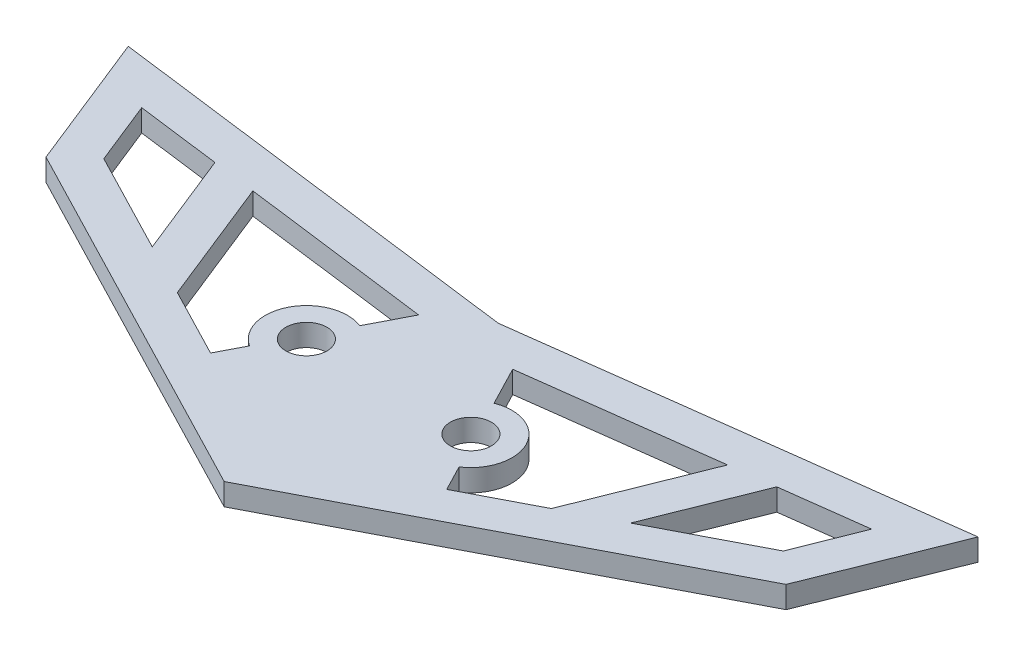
ISO-10303-21;
HEADER;
FILE_DESCRIPTION(('STEP AP214'),'2;1');
FILE_NAME('part.step','',(''),(''),'','','');
FILE_SCHEMA(('AUTOMOTIVE_DESIGN { 1 0 10303 214 1 1 1 1 }'));
ENDSEC;
DATA;
#1=APPLICATION_CONTEXT('core data for automotive mechanical design processes');
#2=APPLICATION_PROTOCOL_DEFINITION('international standard','automotive_design',2000,#1);
#3=PRODUCT_CONTEXT('',#1,'mechanical');
#4=PRODUCT('Part','Part','',(#3));
#5=PRODUCT_RELATED_PRODUCT_CATEGORY('part','',(#4));
#6=PRODUCT_DEFINITION_FORMATION('','',#4);
#7=PRODUCT_DEFINITION_CONTEXT('part definition',#1,'design');
#8=PRODUCT_DEFINITION('design','',#6,#7);
#9=PRODUCT_DEFINITION_SHAPE('','',#8);
#10=(LENGTH_UNIT() NAMED_UNIT(*) SI_UNIT(.MILLI.,.METRE.));
#11=(NAMED_UNIT(*) PLANE_ANGLE_UNIT() SI_UNIT($,.RADIAN.));
#12=(NAMED_UNIT(*) SI_UNIT($,.STERADIAN.) SOLID_ANGLE_UNIT());
#13=UNCERTAINTY_MEASURE_WITH_UNIT(LENGTH_MEASURE(1.E-05),#10,'distance_accuracy_value','');
#14=(GEOMETRIC_REPRESENTATION_CONTEXT(3) GLOBAL_UNCERTAINTY_ASSIGNED_CONTEXT((#13)) GLOBAL_UNIT_ASSIGNED_CONTEXT((#10,
#11,#12)) REPRESENTATION_CONTEXT('',''));
#15=CARTESIAN_POINT('',(0.,0.,0.));
#16=DIRECTION('',(0.,0.,1.));
#17=DIRECTION('',(1.,0.,0.));
#18=AXIS2_PLACEMENT_3D('',#15,#16,#17);
#19=CARTESIAN_POINT('',(0.,0.8,-10.));
#20=DIRECTION('',(0.,-1.,0.));
#21=DIRECTION('',(0.,0.,-1.));
#22=AXIS2_PLACEMENT_3D('',#19,#20,#21);
#23=PLANE('',#22);
#24=DIRECTION('',(0.460317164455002,0.,0.887754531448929));
#25=VECTOR('',#24,1.);
#26=CARTESIAN_POINT('',(2.44955665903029,0.8,-7.39535376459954));
#27=LINE('',#26,#25);
#28=CARTESIAN_POINT('',(1.71612501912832,0.8,-8.80982907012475));
#29=VERTEX_POINT('',#28);
#30=CARTESIAN_POINT('',(2.44955665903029,0.8,-7.39535376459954));
#31=VERTEX_POINT('',#30);
#32=EDGE_CURVE('E353',#29,#31,#27,.T.);
#33=ORIENTED_EDGE('',*,*,#32,.F.);
#34=DIRECTION('',(-0.991777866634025,0.,0.127971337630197));
#35=VECTOR('',#34,1.);
#36=CARTESIAN_POINT('',(1.71612501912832,0.8,-8.80982907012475));
#37=LINE('',#36,#35);
#38=CARTESIAN_POINT('',(8.6585700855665,0.8,-9.70562843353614));
#39=VERTEX_POINT('',#38);
#40=EDGE_CURVE('E50',#39,#29,#37,.T.);
#41=ORIENTED_EDGE('',*,*,#40,.F.);
#42=DIRECTION('',(0.371390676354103,0.,-0.92847669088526));
#43=VECTOR('',#42,1.);
#44=CARTESIAN_POINT('',(8.6585700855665,0.8,-9.70562843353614));
#45=LINE('',#44,#43);
#46=CARTESIAN_POINT('',(6.8220719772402,0.8,-5.11438316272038));
#47=VERTEX_POINT('',#46);
#48=EDGE_CURVE('E338',#47,#39,#45,.T.);
#49=ORIENTED_EDGE('',*,*,#48,.F.);
#50=DIRECTION('',(0.887754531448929,0.,-0.460317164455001));
#51=VECTOR('',#50,1.);
#52=CARTESIAN_POINT('',(6.8220719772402,0.8,-5.11438316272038));
#53=LINE('',#52,#51);
#54=CARTESIAN_POINT('',(4.30817275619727,0.8,-3.81087986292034));
#55=VERTEX_POINT('',#54);
#56=EDGE_CURVE('E362',#55,#47,#53,.T.);
#57=ORIENTED_EDGE('',*,*,#56,.F.);
#58=DIRECTION('',(0.460317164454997,0.,0.887754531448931));
#59=VECTOR('',#58,1.);
#60=CARTESIAN_POINT('',(3.82324448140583,0.8,-4.74609867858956));
#61=LINE('',#60,#59);
#62=CARTESIAN_POINT('',(3.82324448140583,0.8,-4.74609867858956));
#63=VERTEX_POINT('',#62);
#64=EDGE_CURVE('E359',#63,#55,#61,.T.);
#65=ORIENTED_EDGE('',*,*,#64,.F.);
#66=CARTESIAN_POINT('',(3.,0.8,-6.));
#67=DIRECTION('',(0.,-1.,0.));
#68=DIRECTION('',(0.,0.,1.));
#69=AXIS2_PLACEMENT_3D('',#66,#67,#68);
#70=CIRCLE('',#69,1.5);
#71=EDGE_CURVE('E356',#31,#63,#70,.T.);
#72=ORIENTED_EDGE('',*,*,#71,.F.);
#73=EDGE_LOOP('',(#33,#41,#49,#57,#65,#72));
#74=FACE_BOUND('',#73,.T.);
#75=DIRECTION('',(0.887754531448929,0.,-0.460317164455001));
#76=VECTOR('',#75,1.);
#77=CARTESIAN_POINT('',(12.3934527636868,0.8,-8.00324727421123));
#78=LINE('',#77,#76);
#79=CARTESIAN_POINT('',(8.72449468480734,0.8,-6.10082456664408));
#80=VERTEX_POINT('',#79);
#81=CARTESIAN_POINT('',(12.3934527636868,0.8,-8.00324727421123));
#82=VERTEX_POINT('',#81);
#83=EDGE_CURVE('E394',#80,#82,#78,.T.);
#84=ORIENTED_EDGE('',*,*,#83,.F.);
#85=DIRECTION('',(-0.371390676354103,0.,0.92847669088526));
#86=VECTOR('',#85,1.);
#87=CARTESIAN_POINT('',(8.72449468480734,0.8,-6.10082456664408));
#88=LINE('',#87,#86);
#89=CARTESIAN_POINT('',(10.2484758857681,0.8,-9.91077756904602));
#90=VERTEX_POINT('',#89);
#91=EDGE_CURVE('E369',#90,#80,#88,.T.);
#92=ORIENTED_EDGE('',*,*,#91,.F.);
#93=DIRECTION('',(-0.991777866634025,0.,0.127971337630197));
#94=VECTOR('',#93,1.);
#95=CARTESIAN_POINT('',(10.2484758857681,0.8,-9.91077756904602));
#96=LINE('',#95,#94);
#97=CARTESIAN_POINT('',(13.3147227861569,0.8,-10.3064223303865));
#98=VERTEX_POINT('',#97);
#99=EDGE_CURVE('E383',#98,#90,#96,.T.);
#100=ORIENTED_EDGE('',*,*,#99,.F.);
#101=DIRECTION('',(0.371390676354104,0.,-0.92847669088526));
#102=VECTOR('',#101,1.);
#103=CARTESIAN_POINT('',(13.3147227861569,0.8,-10.3064223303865));
#104=LINE('',#103,#102);
#105=EDGE_CURVE('E397',#82,#98,#104,.T.);
#106=ORIENTED_EDGE('',*,*,#105,.F.);
#107=EDGE_LOOP('',(#84,#92,#100,#106));
#108=FACE_BOUND('',#107,.T.);
#109=DIRECTION('',(-0.991777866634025,0.,0.127971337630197));
#110=VECTOR('',#109,1.);
#111=CARTESIAN_POINT('',(15.5,0.8,-12.));
#112=LINE('',#111,#110);
#113=CARTESIAN_POINT('',(15.5,0.8,-12.));
#114=VERTEX_POINT('',#113);
#115=CARTESIAN_POINT('',(0.,0.8,-10.));
#116=VERTEX_POINT('',#115);
#117=EDGE_CURVE('E422',#114,#116,#112,.T.);
#118=ORIENTED_EDGE('',*,*,#117,.T.);
#119=DIRECTION('',(0.991777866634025,0.,0.127971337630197));
#120=VECTOR('',#119,1.);
#121=CARTESIAN_POINT('',(-15.5,0.8,-12.));
#122=LINE('',#121,#120);
#123=CARTESIAN_POINT('',(-15.5,0.8,-12.));
#124=VERTEX_POINT('',#123);
#125=EDGE_CURVE('E314',#124,#116,#122,.T.);
#126=ORIENTED_EDGE('',*,*,#125,.F.);
#127=DIRECTION('',(-0.371390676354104,0.,-0.928476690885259));
#128=VECTOR('',#127,1.);
#129=CARTESIAN_POINT('',(-13.5,0.8,-7.));
#130=LINE('',#129,#128);
#131=CARTESIAN_POINT('',(-13.5,0.8,-7.));
#132=VERTEX_POINT('',#131);
#133=EDGE_CURVE('E310',#132,#124,#130,.T.);
#134=ORIENTED_EDGE('',*,*,#133,.F.);
#135=DIRECTION('',(-0.887754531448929,0.,-0.460317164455));
#136=VECTOR('',#135,1.);
#137=CARTESIAN_POINT('',(0.,0.8,0.));
#138=LINE('',#137,#136);
#139=CARTESIAN_POINT('',(0.,0.8,0.));
#140=VERTEX_POINT('',#139);
#141=EDGE_CURVE('E307',#140,#132,#138,.T.);
#142=ORIENTED_EDGE('',*,*,#141,.F.);
#143=DIRECTION('',(0.887754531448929,0.,-0.460317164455));
#144=VECTOR('',#143,1.);
#145=CARTESIAN_POINT('',(0.,0.8,0.));
#146=LINE('',#145,#144);
#147=CARTESIAN_POINT('',(13.5,0.8,-7.));
#148=VERTEX_POINT('',#147);
#149=EDGE_CURVE('E417',#140,#148,#146,.T.);
#150=ORIENTED_EDGE('',*,*,#149,.T.);
#151=DIRECTION('',(0.371390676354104,0.,-0.928476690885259));
#152=VECTOR('',#151,1.);
#153=CARTESIAN_POINT('',(13.5,0.8,-7.));
#154=LINE('',#153,#152);
#155=EDGE_CURVE('E419',#148,#114,#154,.T.);
#156=ORIENTED_EDGE('',*,*,#155,.T.);
#157=EDGE_LOOP('',(#118,#126,#134,#142,#150,#156));
#158=FACE_BOUND('',#157,.T.);
#159=CARTESIAN_POINT('',(3.,0.8,-6.));
#160=DIRECTION('',(0.,1.,0.));
#161=DIRECTION('',(0.,0.,1.));
#162=AXIS2_PLACEMENT_3D('',#159,#160,#161);
#163=CIRCLE('',#162,0.75);
#164=CARTESIAN_POINT('',(3.,0.8,-5.25));
#165=VERTEX_POINT('',#164);
#166=EDGE_CURVE('E411',#165,#165,#163,.T.);
#167=ORIENTED_EDGE('',*,*,#166,.F.);
#168=EDGE_LOOP('',(#167));
#169=FACE_BOUND('',#168,.T.);
#170=DIRECTION('',(-0.460317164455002,0.,0.887754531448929));
#171=VECTOR('',#170,1.);
#172=CARTESIAN_POINT('',(-2.44955665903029,0.8,-7.39535376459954));
#173=LINE('',#172,#171);
#174=CARTESIAN_POINT('',(-1.71612501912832,0.8,-8.80982907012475));
#175=VERTEX_POINT('',#174);
#176=CARTESIAN_POINT('',(-2.44955665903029,0.8,-7.39535376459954));
#177=VERTEX_POINT('',#176);
#178=EDGE_CURVE('E214',#175,#177,#173,.T.);
#179=ORIENTED_EDGE('',*,*,#178,.T.);
#180=CARTESIAN_POINT('',(-3.,0.8,-6.));
#181=DIRECTION('',(0.,1.,0.));
#182=DIRECTION('',(0.,0.,1.));
#183=AXIS2_PLACEMENT_3D('',#180,#181,#182);
#184=CIRCLE('',#183,1.5);
#185=CARTESIAN_POINT('',(-3.82324448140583,0.8,-4.74609867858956));
#186=VERTEX_POINT('',#185);
#187=EDGE_CURVE('E252',#177,#186,#184,.T.);
#188=ORIENTED_EDGE('',*,*,#187,.T.);
#189=DIRECTION('',(-0.460317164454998,0.,0.887754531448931));
#190=VECTOR('',#189,1.);
#191=CARTESIAN_POINT('',(-3.82324448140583,0.8,-4.74609867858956));
#192=LINE('',#191,#190);
#193=CARTESIAN_POINT('',(-4.30817275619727,0.8,-3.81087986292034));
#194=VERTEX_POINT('',#193);
#195=EDGE_CURVE('E255',#186,#194,#192,.T.);
#196=ORIENTED_EDGE('',*,*,#195,.T.);
#197=DIRECTION('',(-0.887754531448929,0.,-0.460317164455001));
#198=VECTOR('',#197,1.);
#199=CARTESIAN_POINT('',(-6.8220719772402,0.8,-5.11438316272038));
#200=LINE('',#199,#198);
#201=CARTESIAN_POINT('',(-6.8220719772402,0.8,-5.11438316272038));
#202=VERTEX_POINT('',#201);
#203=EDGE_CURVE('E238',#194,#202,#200,.T.);
#204=ORIENTED_EDGE('',*,*,#203,.T.);
#205=DIRECTION('',(-0.371390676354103,0.,-0.92847669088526));
#206=VECTOR('',#205,1.);
#207=CARTESIAN_POINT('',(-8.6585700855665,0.8,-9.70562843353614));
#208=LINE('',#207,#206);
#209=CARTESIAN_POINT('',(-8.6585700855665,0.8,-9.70562843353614));
#210=VERTEX_POINT('',#209);
#211=EDGE_CURVE('E235',#202,#210,#208,.T.);
#212=ORIENTED_EDGE('',*,*,#211,.T.);
#213=DIRECTION('',(0.991777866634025,0.,0.127971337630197));
#214=VECTOR('',#213,1.);
#215=CARTESIAN_POINT('',(-1.71612501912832,0.8,-8.80982907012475));
#216=LINE('',#215,#214);
#217=EDGE_CURVE('E249',#210,#175,#216,.T.);
#218=ORIENTED_EDGE('',*,*,#217,.T.);
#219=EDGE_LOOP('',(#179,#188,#196,#204,#212,#218));
#220=FACE_BOUND('',#219,.T.);
#221=DIRECTION('',(-0.887754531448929,0.,-0.460317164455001));
#222=VECTOR('',#221,1.);
#223=CARTESIAN_POINT('',(-12.3934527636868,0.8,-8.00324727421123));
#224=LINE('',#223,#222);
#225=CARTESIAN_POINT('',(-8.72449468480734,0.8,-6.10082456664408));
#226=VERTEX_POINT('',#225);
#227=CARTESIAN_POINT('',(-12.3934527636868,0.8,-8.00324727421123));
#228=VERTEX_POINT('',#227);
#229=EDGE_CURVE('E285',#226,#228,#224,.T.);
#230=ORIENTED_EDGE('',*,*,#229,.T.);
#231=DIRECTION('',(-0.371390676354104,0.,-0.92847669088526));
#232=VECTOR('',#231,1.);
#233=CARTESIAN_POINT('',(-13.3147227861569,0.8,-10.3064223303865));
#234=LINE('',#233,#232);
#235=CARTESIAN_POINT('',(-13.3147227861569,0.8,-10.3064223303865));
#236=VERTEX_POINT('',#235);
#237=EDGE_CURVE('E288',#228,#236,#234,.T.);
#238=ORIENTED_EDGE('',*,*,#237,.T.);
#239=DIRECTION('',(0.991777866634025,0.,0.127971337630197));
#240=VECTOR('',#239,1.);
#241=CARTESIAN_POINT('',(-10.2484758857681,0.8,-9.91077756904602));
#242=LINE('',#241,#240);
#243=CARTESIAN_POINT('',(-10.2484758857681,0.8,-9.91077756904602));
#244=VERTEX_POINT('',#243);
#245=EDGE_CURVE('E273',#236,#244,#242,.T.);
#246=ORIENTED_EDGE('',*,*,#245,.T.);
#247=DIRECTION('',(0.371390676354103,0.,0.92847669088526));
#248=VECTOR('',#247,1.);
#249=CARTESIAN_POINT('',(-8.72449468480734,0.8,-6.10082456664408));
#250=LINE('',#249,#248);
#251=EDGE_CURVE('E261',#244,#226,#250,.T.);
#252=ORIENTED_EDGE('',*,*,#251,.T.);
#253=EDGE_LOOP('',(#230,#238,#246,#252));
#254=FACE_BOUND('',#253,.T.);
#255=CARTESIAN_POINT('',(-3.,0.8,-6.));
#256=DIRECTION('',(0.,-1.,0.));
#257=DIRECTION('',(0.,0.,1.));
#258=AXIS2_PLACEMENT_3D('',#255,#256,#257);
#259=CIRCLE('',#258,0.75);
#260=CARTESIAN_POINT('',(-3.,0.8,-5.25));
#261=VERTEX_POINT('',#260);
#262=EDGE_CURVE('E301',#261,#261,#259,.T.);
#263=ORIENTED_EDGE('',*,*,#262,.T.);
#264=EDGE_LOOP('',(#263));
#265=FACE_BOUND('',#264,.T.);
#266=ADVANCED_FACE('F35',(#74,#108,#158,#169,#220,#254,#265),#23,.F.);
#267=CARTESIAN_POINT('',(0.,0.,-10.));
#268=DIRECTION('',(0.,-1.,0.));
#269=DIRECTION('',(0.,0.,-1.));
#270=AXIS2_PLACEMENT_3D('',#267,#268,#269);
#271=PLANE('',#270);
#272=DIRECTION('',(-0.991777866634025,0.,0.127971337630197));
#273=VECTOR('',#272,1.);
#274=CARTESIAN_POINT('',(1.71612501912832,0.,-8.80982907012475));
#275=LINE('',#274,#273);
#276=CARTESIAN_POINT('',(8.6585700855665,0.,-9.70562843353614));
#277=VERTEX_POINT('',#276);
#278=CARTESIAN_POINT('',(1.71612501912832,0.,-8.80982907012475));
#279=VERTEX_POINT('',#278);
#280=EDGE_CURVE('E334',#277,#279,#275,.T.);
#281=ORIENTED_EDGE('',*,*,#280,.T.);
#282=DIRECTION('',(0.460317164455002,0.,0.887754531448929));
#283=VECTOR('',#282,1.);
#284=CARTESIAN_POINT('',(2.44955665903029,0.,-7.39535376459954));
#285=LINE('',#284,#283);
#286=CARTESIAN_POINT('',(2.44955665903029,0.,-7.39535376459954));
#287=VERTEX_POINT('',#286);
#288=EDGE_CURVE('E337',#279,#287,#285,.T.);
#289=ORIENTED_EDGE('',*,*,#288,.T.);
#290=CARTESIAN_POINT('',(3.,0.,-6.));
#291=DIRECTION('',(0.,-1.,0.));
#292=DIRECTION('',(0.,0.,1.));
#293=AXIS2_PLACEMENT_3D('',#290,#291,#292);
#294=CIRCLE('',#293,1.5);
#295=CARTESIAN_POINT('',(3.82324448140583,0.,-4.74609867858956));
#296=VERTEX_POINT('',#295);
#297=EDGE_CURVE('E58',#287,#296,#294,.T.);
#298=ORIENTED_EDGE('',*,*,#297,.T.);
#299=DIRECTION('',(0.460317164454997,0.,0.887754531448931));
#300=VECTOR('',#299,1.);
#301=CARTESIAN_POINT('',(3.82324448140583,0.,-4.74609867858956));
#302=LINE('',#301,#300);
#303=CARTESIAN_POINT('',(4.30817275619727,0.,-3.81087986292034));
#304=VERTEX_POINT('',#303);
#305=EDGE_CURVE('E342',#296,#304,#302,.T.);
#306=ORIENTED_EDGE('',*,*,#305,.T.);
#307=DIRECTION('',(0.887754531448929,0.,-0.460317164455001));
#308=VECTOR('',#307,1.);
#309=CARTESIAN_POINT('',(6.8220719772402,0.,-5.11438316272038));
#310=LINE('',#309,#308);
#311=CARTESIAN_POINT('',(6.8220719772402,0.,-5.11438316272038));
#312=VERTEX_POINT('',#311);
#313=EDGE_CURVE('E345',#304,#312,#310,.T.);
#314=ORIENTED_EDGE('',*,*,#313,.T.);
#315=DIRECTION('',(0.371390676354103,0.,-0.92847669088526));
#316=VECTOR('',#315,1.);
#317=CARTESIAN_POINT('',(8.6585700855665,0.,-9.70562843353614));
#318=LINE('',#317,#316);
#319=EDGE_CURVE('E348',#312,#277,#318,.T.);
#320=ORIENTED_EDGE('',*,*,#319,.T.);
#321=EDGE_LOOP('',(#281,#289,#298,#306,#314,#320));
#322=FACE_BOUND('',#321,.T.);
#323=DIRECTION('',(-0.371390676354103,0.,0.92847669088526));
#324=VECTOR('',#323,1.);
#325=CARTESIAN_POINT('',(8.72449468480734,0.,-6.10082456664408));
#326=LINE('',#325,#324);
#327=CARTESIAN_POINT('',(10.2484758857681,0.,-9.91077756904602));
#328=VERTEX_POINT('',#327);
#329=CARTESIAN_POINT('',(8.72449468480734,0.,-6.10082456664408));
#330=VERTEX_POINT('',#329);
#331=EDGE_CURVE('E379',#328,#330,#326,.T.);
#332=ORIENTED_EDGE('',*,*,#331,.T.);
#333=DIRECTION('',(0.887754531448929,0.,-0.460317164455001));
#334=VECTOR('',#333,1.);
#335=CARTESIAN_POINT('',(12.3934527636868,0.,-8.00324727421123));
#336=LINE('',#335,#334);
#337=CARTESIAN_POINT('',(12.3934527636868,0.,-8.00324727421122));
#338=VERTEX_POINT('',#337);
#339=EDGE_CURVE('E382',#330,#338,#336,.T.);
#340=ORIENTED_EDGE('',*,*,#339,.T.);
#341=DIRECTION('',(0.371390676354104,0.,-0.92847669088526));
#342=VECTOR('',#341,1.);
#343=CARTESIAN_POINT('',(13.3147227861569,0.,-10.3064223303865));
#344=LINE('',#343,#342);
#345=CARTESIAN_POINT('',(13.3147227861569,0.,-10.3064223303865));
#346=VERTEX_POINT('',#345);
#347=EDGE_CURVE('E386',#338,#346,#344,.T.);
#348=ORIENTED_EDGE('',*,*,#347,.T.);
#349=DIRECTION('',(-0.991777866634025,0.,0.127971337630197));
#350=VECTOR('',#349,1.);
#351=CARTESIAN_POINT('',(10.2484758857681,0.,-9.91077756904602));
#352=LINE('',#351,#350);
#353=EDGE_CURVE('E389',#346,#328,#352,.T.);
#354=ORIENTED_EDGE('',*,*,#353,.T.);
#355=EDGE_LOOP('',(#332,#340,#348,#354));
#356=FACE_BOUND('',#355,.T.);
#357=DIRECTION('',(0.887754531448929,0.,-0.460317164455));
#358=VECTOR('',#357,1.);
#359=CARTESIAN_POINT('',(0.,0.,0.));
#360=LINE('',#359,#358);
#361=CARTESIAN_POINT('',(0.,0.,0.));
#362=VERTEX_POINT('',#361);
#363=CARTESIAN_POINT('',(13.5,0.,-7.));
#364=VERTEX_POINT('',#363);
#365=EDGE_CURVE('E414',#362,#364,#360,.T.);
#366=ORIENTED_EDGE('',*,*,#365,.F.);
#367=DIRECTION('',(-0.887754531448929,0.,-0.460317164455));
#368=VECTOR('',#367,1.);
#369=CARTESIAN_POINT('',(0.,0.,0.));
#370=LINE('',#369,#368);
#371=CARTESIAN_POINT('',(-13.5,0.,-7.));
#372=VERTEX_POINT('',#371);
#373=EDGE_CURVE('E304',#362,#372,#370,.T.);
#374=ORIENTED_EDGE('',*,*,#373,.T.);
#375=DIRECTION('',(-0.371390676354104,0.,-0.928476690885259));
#376=VECTOR('',#375,1.);
#377=CARTESIAN_POINT('',(-13.5,0.,-7.));
#378=LINE('',#377,#376);
#379=CARTESIAN_POINT('',(-15.5,0.,-12.));
#380=VERTEX_POINT('',#379);
#381=EDGE_CURVE('E320',#372,#380,#378,.T.);
#382=ORIENTED_EDGE('',*,*,#381,.T.);
#383=DIRECTION('',(0.991777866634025,0.,0.127971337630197));
#384=VECTOR('',#383,1.);
#385=CARTESIAN_POINT('',(-15.5,0.,-12.));
#386=LINE('',#385,#384);
#387=CARTESIAN_POINT('',(0.,0.,-10.));
#388=VERTEX_POINT('',#387);
#389=EDGE_CURVE('E311',#380,#388,#386,.T.);
#390=ORIENTED_EDGE('',*,*,#389,.T.);
#391=DIRECTION('',(-0.991777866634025,0.,0.127971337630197));
#392=VECTOR('',#391,1.);
#393=CARTESIAN_POINT('',(15.5,0.,-12.));
#394=LINE('',#393,#392);
#395=CARTESIAN_POINT('',(15.5,0.,-12.));
#396=VERTEX_POINT('',#395);
#397=EDGE_CURVE('E420',#396,#388,#394,.T.);
#398=ORIENTED_EDGE('',*,*,#397,.F.);
#399=DIRECTION('',(0.371390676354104,0.,-0.928476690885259));
#400=VECTOR('',#399,1.);
#401=CARTESIAN_POINT('',(13.5,0.,-7.));
#402=LINE('',#401,#400);
#403=EDGE_CURVE('E425',#364,#396,#402,.T.);
#404=ORIENTED_EDGE('',*,*,#403,.F.);
#405=EDGE_LOOP('',(#366,#374,#382,#390,#398,#404));
#406=FACE_BOUND('',#405,.T.);
#407=CARTESIAN_POINT('',(3.,0.,-6.));
#408=DIRECTION('',(0.,1.,0.));
#409=DIRECTION('',(0.,0.,1.));
#410=AXIS2_PLACEMENT_3D('',#407,#408,#409);
#411=CIRCLE('',#410,0.75);
#412=CARTESIAN_POINT('',(3.,0.,-5.25));
#413=VERTEX_POINT('',#412);
#414=EDGE_CURVE('E404',#413,#413,#411,.T.);
#415=ORIENTED_EDGE('',*,*,#414,.T.);
#416=EDGE_LOOP('',(#415));
#417=FACE_BOUND('',#416,.T.);
#418=DIRECTION('',(0.991777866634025,0.,0.127971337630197));
#419=VECTOR('',#418,1.);
#420=CARTESIAN_POINT('',(-1.71612501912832,0.,-8.80982907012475));
#421=LINE('',#420,#419);
#422=CARTESIAN_POINT('',(-8.6585700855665,0.,-9.70562843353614));
#423=VERTEX_POINT('',#422);
#424=CARTESIAN_POINT('',(-1.71612501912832,0.,-8.80982907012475));
#425=VERTEX_POINT('',#424);
#426=EDGE_CURVE('E227',#423,#425,#421,.T.);
#427=ORIENTED_EDGE('',*,*,#426,.F.);
#428=DIRECTION('',(-0.371390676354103,0.,-0.92847669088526));
#429=VECTOR('',#428,1.);
#430=CARTESIAN_POINT('',(-8.6585700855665,0.,-9.70562843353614));
#431=LINE('',#430,#429);
#432=CARTESIAN_POINT('',(-6.8220719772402,0.,-5.11438316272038));
#433=VERTEX_POINT('',#432);
#434=EDGE_CURVE('E220',#433,#423,#431,.T.);
#435=ORIENTED_EDGE('',*,*,#434,.F.);
#436=DIRECTION('',(-0.887754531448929,0.,-0.460317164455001));
#437=VECTOR('',#436,1.);
#438=CARTESIAN_POINT('',(-6.8220719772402,0.,-5.11438316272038));
#439=LINE('',#438,#437);
#440=CARTESIAN_POINT('',(-4.30817275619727,0.,-3.81087986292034));
#441=VERTEX_POINT('',#440);
#442=EDGE_CURVE('E245',#441,#433,#439,.T.);
#443=ORIENTED_EDGE('',*,*,#442,.F.);
#444=DIRECTION('',(-0.460317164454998,0.,0.887754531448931));
#445=VECTOR('',#444,1.);
#446=CARTESIAN_POINT('',(-3.82324448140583,0.,-4.74609867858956));
#447=LINE('',#446,#445);
#448=CARTESIAN_POINT('',(-3.82324448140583,0.,-4.74609867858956));
#449=VERTEX_POINT('',#448);
#450=EDGE_CURVE('E242',#449,#441,#447,.T.);
#451=ORIENTED_EDGE('',*,*,#450,.F.);
#452=CARTESIAN_POINT('',(-3.,0.,-6.));
#453=DIRECTION('',(0.,1.,0.));
#454=DIRECTION('',(0.,0.,1.));
#455=AXIS2_PLACEMENT_3D('',#452,#453,#454);
#456=CIRCLE('',#455,1.5);
#457=CARTESIAN_POINT('',(-2.44955665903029,0.,-7.39535376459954));
#458=VERTEX_POINT('',#457);
#459=EDGE_CURVE('E230',#458,#449,#456,.T.);
#460=ORIENTED_EDGE('',*,*,#459,.F.);
#461=DIRECTION('',(-0.460317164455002,0.,0.887754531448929));
#462=VECTOR('',#461,1.);
#463=CARTESIAN_POINT('',(-2.44955665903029,0.,-7.39535376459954));
#464=LINE('',#463,#462);
#465=EDGE_CURVE('E211',#425,#458,#464,.T.);
#466=ORIENTED_EDGE('',*,*,#465,.F.);
#467=EDGE_LOOP('',(#427,#435,#443,#451,#460,#466));
#468=FACE_BOUND('',#467,.T.);
#469=DIRECTION('',(0.371390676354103,0.,0.92847669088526));
#470=VECTOR('',#469,1.);
#471=CARTESIAN_POINT('',(-8.72449468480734,0.,-6.10082456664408));
#472=LINE('',#471,#470);
#473=CARTESIAN_POINT('',(-10.2484758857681,0.,-9.91077756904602));
#474=VERTEX_POINT('',#473);
#475=CARTESIAN_POINT('',(-8.72449468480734,0.,-6.10082456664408));
#476=VERTEX_POINT('',#475);
#477=EDGE_CURVE('E269',#474,#476,#472,.T.);
#478=ORIENTED_EDGE('',*,*,#477,.F.);
#479=DIRECTION('',(0.991777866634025,0.,0.127971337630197));
#480=VECTOR('',#479,1.);
#481=CARTESIAN_POINT('',(-10.2484758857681,0.,-9.91077756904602));
#482=LINE('',#481,#480);
#483=CARTESIAN_POINT('',(-13.3147227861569,0.,-10.3064223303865));
#484=VERTEX_POINT('',#483);
#485=EDGE_CURVE('E279',#484,#474,#482,.T.);
#486=ORIENTED_EDGE('',*,*,#485,.F.);
#487=DIRECTION('',(-0.371390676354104,0.,-0.92847669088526));
#488=VECTOR('',#487,1.);
#489=CARTESIAN_POINT('',(-13.3147227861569,0.,-10.3064223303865));
#490=LINE('',#489,#488);
#491=CARTESIAN_POINT('',(-12.3934527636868,0.,-8.00324727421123));
#492=VERTEX_POINT('',#491);
#493=EDGE_CURVE('E276',#492,#484,#490,.T.);
#494=ORIENTED_EDGE('',*,*,#493,.F.);
#495=DIRECTION('',(-0.887754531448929,0.,-0.460317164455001));
#496=VECTOR('',#495,1.);
#497=CARTESIAN_POINT('',(-12.3934527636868,0.,-8.00324727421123));
#498=LINE('',#497,#496);
#499=EDGE_CURVE('E272',#476,#492,#498,.T.);
#500=ORIENTED_EDGE('',*,*,#499,.F.);
#501=EDGE_LOOP('',(#478,#486,#494,#500));
#502=FACE_BOUND('',#501,.T.);
#503=CARTESIAN_POINT('',(-3.,0.,-6.));
#504=DIRECTION('',(0.,-1.,0.));
#505=DIRECTION('',(0.,0.,1.));
#506=AXIS2_PLACEMENT_3D('',#503,#504,#505);
#507=CIRCLE('',#506,0.75);
#508=CARTESIAN_POINT('',(-3.,0.,-5.25));
#509=VERTEX_POINT('',#508);
#510=EDGE_CURVE('E295',#509,#509,#507,.T.);
#511=ORIENTED_EDGE('',*,*,#510,.F.);
#512=EDGE_LOOP('',(#511));
#513=FACE_BOUND('',#512,.T.);
#514=ADVANCED_FACE('F224',(#322,#356,#406,#417,#468,#502,#513),#271,.T.);
#515=CARTESIAN_POINT('',(0.,0.8,0.));
#516=DIRECTION('',(-0.460317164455,0.,-0.887754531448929));
#517=DIRECTION('',(-0.887754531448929,0.,0.460317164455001));
#518=AXIS2_PLACEMENT_3D('',#515,#516,#517);
#519=PLANE('',#518);
#520=ORIENTED_EDGE('',*,*,#365,.T.);
#521=DIRECTION('',(0.,-1.,0.));
#522=VECTOR('',#521,1.);
#523=CARTESIAN_POINT('',(13.5,0.8,-7.));
#524=LINE('',#523,#522);
#525=EDGE_CURVE('E11',#148,#364,#524,.T.);
#526=ORIENTED_EDGE('',*,*,#525,.F.);
#527=ORIENTED_EDGE('',*,*,#149,.F.);
#528=DIRECTION('',(0.,-1.,0.));
#529=VECTOR('',#528,1.);
#530=CARTESIAN_POINT('',(0.,0.8,0.));
#531=LINE('',#530,#529);
#532=EDGE_CURVE('E331',#140,#362,#531,.T.);
#533=ORIENTED_EDGE('',*,*,#532,.T.);
#534=EDGE_LOOP('',(#520,#526,#527,#533));
#535=FACE_BOUND('',#534,.T.);
#536=ADVANCED_FACE('F37',(#535),#519,.F.);
#537=CARTESIAN_POINT('',(13.5,0.8,-7.));
#538=DIRECTION('',(-0.928476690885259,0.,-0.371390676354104));
#539=DIRECTION('',(-0.371390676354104,0.,0.928476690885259));
#540=AXIS2_PLACEMENT_3D('',#537,#538,#539);
#541=PLANE('',#540);
#542=ORIENTED_EDGE('',*,*,#403,.T.);
#543=DIRECTION('',(0.,-1.,0.));
#544=VECTOR('',#543,1.);
#545=CARTESIAN_POINT('',(15.5,0.8,-12.));
#546=LINE('',#545,#544);
#547=EDGE_CURVE('E43',#114,#396,#546,.T.);
#548=ORIENTED_EDGE('',*,*,#547,.F.);
#549=ORIENTED_EDGE('',*,*,#155,.F.);
#550=ORIENTED_EDGE('',*,*,#525,.T.);
#551=EDGE_LOOP('',(#542,#548,#549,#550));
#552=FACE_BOUND('',#551,.T.);
#553=ADVANCED_FACE('F449',(#552),#541,.F.);
#554=CARTESIAN_POINT('',(15.5,0.8,-12.));
#555=DIRECTION('',(0.127971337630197,0.,0.991777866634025));
#556=DIRECTION('',(0.991777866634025,0.,-0.127971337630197));
#557=AXIS2_PLACEMENT_3D('',#554,#555,#556);
#558=PLANE('',#557);
#559=ORIENTED_EDGE('',*,*,#397,.T.);
#560=DIRECTION('',(0.,-1.,0.));
#561=VECTOR('',#560,1.);
#562=CARTESIAN_POINT('',(0.,0.8,-10.));
#563=LINE('',#562,#561);
#564=EDGE_CURVE('E317',#116,#388,#563,.T.);
#565=ORIENTED_EDGE('',*,*,#564,.F.);
#566=ORIENTED_EDGE('',*,*,#117,.F.);
#567=ORIENTED_EDGE('',*,*,#547,.T.);
#568=EDGE_LOOP('',(#559,#565,#566,#567));
#569=FACE_BOUND('',#568,.T.);
#570=ADVANCED_FACE('F432',(#569),#558,.F.);
#571=CARTESIAN_POINT('',(3.,0.8,-6.));
#572=DIRECTION('',(0.,-1.,0.));
#573=DIRECTION('',(0.,0.,-1.));
#574=AXIS2_PLACEMENT_3D('',#571,#572,#573);
#575=CYLINDRICAL_SURFACE('',#574,0.75);
#576=ORIENTED_EDGE('',*,*,#166,.T.);
#577=EDGE_LOOP('',(#576));
#578=FACE_BOUND('',#577,.T.);
#579=ORIENTED_EDGE('',*,*,#414,.F.);
#580=EDGE_LOOP('',(#579));
#581=FACE_BOUND('',#580,.T.);
#582=ADVANCED_FACE('F478',(#578,#581),#575,.F.);
#583=CARTESIAN_POINT('',(8.72449468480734,0.,-6.10082456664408));
#584=DIRECTION('',(-0.928476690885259,0.,-0.371390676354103));
#585=DIRECTION('',(-0.371390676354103,0.,0.92847669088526));
#586=AXIS2_PLACEMENT_3D('',#583,#584,#585);
#587=PLANE('',#586);
#588=ORIENTED_EDGE('',*,*,#91,.T.);
#589=DIRECTION('',(0.,1.,0.));
#590=VECTOR('',#589,1.);
#591=CARTESIAN_POINT('',(8.72449468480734,0.,-6.10082456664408));
#592=LINE('',#591,#590);
#593=EDGE_CURVE('E392',#330,#80,#592,.T.);
#594=ORIENTED_EDGE('',*,*,#593,.F.);
#595=ORIENTED_EDGE('',*,*,#331,.F.);
#596=DIRECTION('',(0.,1.,0.));
#597=VECTOR('',#596,1.);
#598=CARTESIAN_POINT('',(10.2484758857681,0.,-9.91077756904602));
#599=LINE('',#598,#597);
#600=EDGE_CURVE('E402',#328,#90,#599,.T.);
#601=ORIENTED_EDGE('',*,*,#600,.T.);
#602=EDGE_LOOP('',(#588,#594,#595,#601));
#603=FACE_BOUND('',#602,.T.);
#604=ADVANCED_FACE('F579',(#603),#587,.F.);
#605=CARTESIAN_POINT('',(10.2484758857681,0.,-9.91077756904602));
#606=DIRECTION('',(-0.127971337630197,0.,-0.991777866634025));
#607=DIRECTION('',(-0.991777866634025,0.,0.127971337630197));
#608=AXIS2_PLACEMENT_3D('',#605,#606,#607);
#609=PLANE('',#608);
#610=ORIENTED_EDGE('',*,*,#99,.T.);
#611=ORIENTED_EDGE('',*,*,#600,.F.);
#612=ORIENTED_EDGE('',*,*,#353,.F.);
#613=DIRECTION('',(0.,1.,0.));
#614=VECTOR('',#613,1.);
#615=CARTESIAN_POINT('',(13.3147227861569,0.,-10.3064223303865));
#616=LINE('',#615,#614);
#617=EDGE_CURVE('E405',#346,#98,#616,.T.);
#618=ORIENTED_EDGE('',*,*,#617,.T.);
#619=EDGE_LOOP('',(#610,#611,#612,#618));
#620=FACE_BOUND('',#619,.T.);
#621=ADVANCED_FACE('F562',(#620),#609,.F.);
#622=CARTESIAN_POINT('',(13.3147227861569,0.,-10.3064223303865));
#623=DIRECTION('',(0.928476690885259,0.,0.371390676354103));
#624=DIRECTION('',(0.371390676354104,0.,-0.928476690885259));
#625=AXIS2_PLACEMENT_3D('',#622,#623,#624);
#626=PLANE('',#625);
#627=ORIENTED_EDGE('',*,*,#105,.T.);
#628=ORIENTED_EDGE('',*,*,#617,.F.);
#629=ORIENTED_EDGE('',*,*,#347,.F.);
#630=DIRECTION('',(0.,1.,0.));
#631=VECTOR('',#630,1.);
#632=CARTESIAN_POINT('',(12.3934527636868,0.,-8.00324727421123));
#633=LINE('',#632,#631);
#634=EDGE_CURVE('E407',#338,#82,#633,.T.);
#635=ORIENTED_EDGE('',*,*,#634,.T.);
#636=EDGE_LOOP('',(#627,#628,#629,#635));
#637=FACE_BOUND('',#636,.T.);
#638=ADVANCED_FACE('F558',(#637),#626,.F.);
#639=CARTESIAN_POINT('',(12.3934527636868,0.,-8.00324727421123));
#640=DIRECTION('',(0.460317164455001,0.,0.887754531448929));
#641=DIRECTION('',(0.887754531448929,0.,-0.460317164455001));
#642=AXIS2_PLACEMENT_3D('',#639,#640,#641);
#643=PLANE('',#642);
#644=ORIENTED_EDGE('',*,*,#83,.T.);
#645=ORIENTED_EDGE('',*,*,#634,.F.);
#646=ORIENTED_EDGE('',*,*,#339,.F.);
#647=ORIENTED_EDGE('',*,*,#593,.T.);
#648=EDGE_LOOP('',(#644,#645,#646,#647));
#649=FACE_BOUND('',#648,.T.);
#650=ADVANCED_FACE('F553',(#649),#643,.F.);
#651=CARTESIAN_POINT('',(1.71612501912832,0.,-8.80982907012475));
#652=DIRECTION('',(-0.127971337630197,0.,-0.991777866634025));
#653=DIRECTION('',(-0.991777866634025,0.,0.127971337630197));
#654=AXIS2_PLACEMENT_3D('',#651,#652,#653);
#655=PLANE('',#654);
#656=ORIENTED_EDGE('',*,*,#40,.T.);
#657=DIRECTION('',(0.,1.,0.));
#658=VECTOR('',#657,1.);
#659=CARTESIAN_POINT('',(1.71612501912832,0.,-8.80982907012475));
#660=LINE('',#659,#658);
#661=EDGE_CURVE('E351',#279,#29,#660,.T.);
#662=ORIENTED_EDGE('',*,*,#661,.F.);
#663=ORIENTED_EDGE('',*,*,#280,.F.);
#664=DIRECTION('',(0.,1.,0.));
#665=VECTOR('',#664,1.);
#666=CARTESIAN_POINT('',(8.6585700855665,0.,-9.70562843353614));
#667=LINE('',#666,#665);
#668=EDGE_CURVE('E367',#277,#39,#667,.T.);
#669=ORIENTED_EDGE('',*,*,#668,.T.);
#670=EDGE_LOOP('',(#656,#662,#663,#669));
#671=FACE_BOUND('',#670,.T.);
#672=ADVANCED_FACE('F511',(#671),#655,.F.);
#673=CARTESIAN_POINT('',(8.6585700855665,0.,-9.70562843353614));
#674=DIRECTION('',(0.92847669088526,0.,0.371390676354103));
#675=DIRECTION('',(0.371390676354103,0.,-0.928476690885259));
#676=AXIS2_PLACEMENT_3D('',#673,#674,#675);
#677=PLANE('',#676);
#678=ORIENTED_EDGE('',*,*,#48,.T.);
#679=ORIENTED_EDGE('',*,*,#668,.F.);
#680=ORIENTED_EDGE('',*,*,#319,.F.);
#681=DIRECTION('',(0.,1.,0.));
#682=VECTOR('',#681,1.);
#683=CARTESIAN_POINT('',(6.8220719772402,0.,-5.11438316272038));
#684=LINE('',#683,#682);
#685=EDGE_CURVE('E370',#312,#47,#684,.T.);
#686=ORIENTED_EDGE('',*,*,#685,.T.);
#687=EDGE_LOOP('',(#678,#679,#680,#686));
#688=FACE_BOUND('',#687,.T.);
#689=ADVANCED_FACE('F506',(#688),#677,.F.);
#690=CARTESIAN_POINT('',(6.8220719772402,0.,-5.11438316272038));
#691=DIRECTION('',(0.460317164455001,0.,0.887754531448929));
#692=DIRECTION('',(0.887754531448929,0.,-0.460317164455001));
#693=AXIS2_PLACEMENT_3D('',#690,#691,#692);
#694=PLANE('',#693);
#695=ORIENTED_EDGE('',*,*,#56,.T.);
#696=ORIENTED_EDGE('',*,*,#685,.F.);
#697=ORIENTED_EDGE('',*,*,#313,.F.);
#698=DIRECTION('',(0.,1.,0.));
#699=VECTOR('',#698,1.);
#700=CARTESIAN_POINT('',(4.30817275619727,0.,-3.81087986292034));
#701=LINE('',#700,#699);
#702=EDGE_CURVE('E372',#304,#55,#701,.T.);
#703=ORIENTED_EDGE('',*,*,#702,.T.);
#704=EDGE_LOOP('',(#695,#696,#697,#703));
#705=FACE_BOUND('',#704,.T.);
#706=ADVANCED_FACE('F510',(#705),#694,.F.);
#707=CARTESIAN_POINT('',(3.82324448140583,0.,-4.74609867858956));
#708=DIRECTION('',(-0.887754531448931,0.,0.460317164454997));
#709=DIRECTION('',(0.460317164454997,0.,0.887754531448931));
#710=AXIS2_PLACEMENT_3D('',#707,#708,#709);
#711=PLANE('',#710);
#712=ORIENTED_EDGE('',*,*,#64,.T.);
#713=ORIENTED_EDGE('',*,*,#702,.F.);
#714=ORIENTED_EDGE('',*,*,#305,.F.);
#715=DIRECTION('',(0.,1.,0.));
#716=VECTOR('',#715,1.);
#717=CARTESIAN_POINT('',(3.82324448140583,0.,-4.74609867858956));
#718=LINE('',#717,#716);
#719=EDGE_CURVE('E374',#296,#63,#718,.T.);
#720=ORIENTED_EDGE('',*,*,#719,.T.);
#721=EDGE_LOOP('',(#712,#713,#714,#720));
#722=FACE_BOUND('',#721,.T.);
#723=ADVANCED_FACE('F520',(#722),#711,.F.);
#724=CARTESIAN_POINT('',(3.,0.,-6.));
#725=DIRECTION('',(0.,1.,0.));
#726=DIRECTION('',(0.,0.,1.));
#727=AXIS2_PLACEMENT_3D('',#724,#725,#726);
#728=CYLINDRICAL_SURFACE('',#727,1.5);
#729=ORIENTED_EDGE('',*,*,#71,.T.);
#730=ORIENTED_EDGE('',*,*,#719,.F.);
#731=ORIENTED_EDGE('',*,*,#297,.F.);
#732=DIRECTION('',(0.,1.,0.));
#733=VECTOR('',#732,1.);
#734=CARTESIAN_POINT('',(2.44955665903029,0.,-7.39535376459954));
#735=LINE('',#734,#733);
#736=EDGE_CURVE('E376',#287,#31,#735,.T.);
#737=ORIENTED_EDGE('',*,*,#736,.T.);
#738=EDGE_LOOP('',(#729,#730,#731,#737));
#739=FACE_BOUND('',#738,.T.);
#740=ADVANCED_FACE('F529',(#739),#728,.T.);
#741=CARTESIAN_POINT('',(2.44955665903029,0.,-7.39535376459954));
#742=DIRECTION('',(-0.887754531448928,0.,0.460317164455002));
#743=DIRECTION('',(0.460317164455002,0.,0.887754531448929));
#744=AXIS2_PLACEMENT_3D('',#741,#742,#743);
#745=PLANE('',#744);
#746=ORIENTED_EDGE('',*,*,#32,.T.);
#747=ORIENTED_EDGE('',*,*,#736,.F.);
#748=ORIENTED_EDGE('',*,*,#288,.F.);
#749=ORIENTED_EDGE('',*,*,#661,.T.);
#750=EDGE_LOOP('',(#746,#747,#748,#749));
#751=FACE_BOUND('',#750,.T.);
#752=ADVANCED_FACE('F465',(#751),#745,.F.);
#753=CARTESIAN_POINT('',(0.,0.8,0.));
#754=DIRECTION('',(0.460317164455,0.,-0.887754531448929));
#755=DIRECTION('',(0.887754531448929,0.,0.460317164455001));
#756=AXIS2_PLACEMENT_3D('',#753,#754,#755);
#757=PLANE('',#756);
#758=ORIENTED_EDGE('',*,*,#373,.F.);
#759=ORIENTED_EDGE('',*,*,#532,.F.);
#760=ORIENTED_EDGE('',*,*,#141,.T.);
#761=DIRECTION('',(0.,-1.,0.));
#762=VECTOR('',#761,1.);
#763=CARTESIAN_POINT('',(-13.5,0.8,-7.));
#764=LINE('',#763,#762);
#765=EDGE_CURVE('E329',#132,#372,#764,.T.);
#766=ORIENTED_EDGE('',*,*,#765,.T.);
#767=EDGE_LOOP('',(#758,#759,#760,#766));
#768=FACE_BOUND('',#767,.T.);
#769=ADVANCED_FACE('F454',(#768),#757,.F.);
#770=CARTESIAN_POINT('',(-13.5,0.8,-7.));
#771=DIRECTION('',(0.928476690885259,0.,-0.371390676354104));
#772=DIRECTION('',(0.371390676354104,0.,0.928476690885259));
#773=AXIS2_PLACEMENT_3D('',#770,#771,#772);
#774=PLANE('',#773);
#775=ORIENTED_EDGE('',*,*,#381,.F.);
#776=ORIENTED_EDGE('',*,*,#765,.F.);
#777=ORIENTED_EDGE('',*,*,#133,.T.);
#778=DIRECTION('',(0.,-1.,0.));
#779=VECTOR('',#778,1.);
#780=CARTESIAN_POINT('',(-15.5,0.8,-12.));
#781=LINE('',#780,#779);
#782=EDGE_CURVE('E327',#124,#380,#781,.T.);
#783=ORIENTED_EDGE('',*,*,#782,.T.);
#784=EDGE_LOOP('',(#775,#776,#777,#783));
#785=FACE_BOUND('',#784,.T.);
#786=ADVANCED_FACE('F456',(#785),#774,.F.);
#787=CARTESIAN_POINT('',(-15.5,0.8,-12.));
#788=DIRECTION('',(-0.127971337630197,0.,0.991777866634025));
#789=DIRECTION('',(-0.991777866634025,0.,-0.127971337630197));
#790=AXIS2_PLACEMENT_3D('',#787,#788,#789);
#791=PLANE('',#790);
#792=ORIENTED_EDGE('',*,*,#389,.F.);
#793=ORIENTED_EDGE('',*,*,#782,.F.);
#794=ORIENTED_EDGE('',*,*,#125,.T.);
#795=ORIENTED_EDGE('',*,*,#564,.T.);
#796=EDGE_LOOP('',(#792,#793,#794,#795));
#797=FACE_BOUND('',#796,.T.);
#798=ADVANCED_FACE('F442',(#797),#791,.F.);
#799=CARTESIAN_POINT('',(-3.,0.8,-6.));
#800=DIRECTION('',(0.,-1.,0.));
#801=DIRECTION('',(0.,0.,-1.));
#802=AXIS2_PLACEMENT_3D('',#799,#800,#801);
#803=CYLINDRICAL_SURFACE('',#802,0.75);
#804=ORIENTED_EDGE('',*,*,#262,.F.);
#805=EDGE_LOOP('',(#804));
#806=FACE_BOUND('',#805,.T.);
#807=ORIENTED_EDGE('',*,*,#510,.T.);
#808=EDGE_LOOP('',(#807));
#809=FACE_BOUND('',#808,.T.);
#810=ADVANCED_FACE('F463',(#806,#809),#803,.F.);
#811=CARTESIAN_POINT('',(-8.72449468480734,0.,-6.10082456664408));
#812=DIRECTION('',(0.928476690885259,0.,-0.371390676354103));
#813=DIRECTION('',(0.371390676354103,0.,0.92847669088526));
#814=AXIS2_PLACEMENT_3D('',#811,#812,#813);
#815=PLANE('',#814);
#816=ORIENTED_EDGE('',*,*,#251,.F.);
#817=DIRECTION('',(0.,1.,0.));
#818=VECTOR('',#817,1.);
#819=CARTESIAN_POINT('',(-10.2484758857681,0.,-9.91077756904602));
#820=LINE('',#819,#818);
#821=EDGE_CURVE('E293',#474,#244,#820,.T.);
#822=ORIENTED_EDGE('',*,*,#821,.F.);
#823=ORIENTED_EDGE('',*,*,#477,.T.);
#824=DIRECTION('',(0.,1.,0.));
#825=VECTOR('',#824,1.);
#826=CARTESIAN_POINT('',(-8.72449468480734,0.,-6.10082456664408));
#827=LINE('',#826,#825);
#828=EDGE_CURVE('E282',#476,#226,#827,.T.);
#829=ORIENTED_EDGE('',*,*,#828,.T.);
#830=EDGE_LOOP('',(#816,#822,#823,#829));
#831=FACE_BOUND('',#830,.T.);
#832=ADVANCED_FACE('F632',(#831),#815,.F.);
#833=CARTESIAN_POINT('',(-10.2484758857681,0.,-9.91077756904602));
#834=DIRECTION('',(0.127971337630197,0.,-0.991777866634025));
#835=DIRECTION('',(0.991777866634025,0.,0.127971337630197));
#836=AXIS2_PLACEMENT_3D('',#833,#834,#835);
#837=PLANE('',#836);
#838=ORIENTED_EDGE('',*,*,#245,.F.);
#839=DIRECTION('',(0.,1.,0.));
#840=VECTOR('',#839,1.);
#841=CARTESIAN_POINT('',(-13.3147227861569,0.,-10.3064223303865));
#842=LINE('',#841,#840);
#843=EDGE_CURVE('E296',#484,#236,#842,.T.);
#844=ORIENTED_EDGE('',*,*,#843,.F.);
#845=ORIENTED_EDGE('',*,*,#485,.T.);
#846=ORIENTED_EDGE('',*,*,#821,.T.);
#847=EDGE_LOOP('',(#838,#844,#845,#846));
#848=FACE_BOUND('',#847,.T.);
#849=ADVANCED_FACE('F642',(#848),#837,.F.);
#850=CARTESIAN_POINT('',(-13.3147227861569,0.,-10.3064223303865));
#851=DIRECTION('',(-0.928476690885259,0.,0.371390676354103));
#852=DIRECTION('',(-0.371390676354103,0.,-0.928476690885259));
#853=AXIS2_PLACEMENT_3D('',#850,#851,#852);
#854=PLANE('',#853);
#855=ORIENTED_EDGE('',*,*,#237,.F.);
#856=DIRECTION('',(0.,1.,0.));
#857=VECTOR('',#856,1.);
#858=CARTESIAN_POINT('',(-12.3934527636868,0.,-8.00324727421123));
#859=LINE('',#858,#857);
#860=EDGE_CURVE('E298',#492,#228,#859,.T.);
#861=ORIENTED_EDGE('',*,*,#860,.F.);
#862=ORIENTED_EDGE('',*,*,#493,.T.);
#863=ORIENTED_EDGE('',*,*,#843,.T.);
#864=EDGE_LOOP('',(#855,#861,#862,#863));
#865=FACE_BOUND('',#864,.T.);
#866=ADVANCED_FACE('F652',(#865),#854,.F.);
#867=CARTESIAN_POINT('',(-12.3934527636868,0.,-8.00324727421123));
#868=DIRECTION('',(-0.460317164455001,0.,0.887754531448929));
#869=DIRECTION('',(-0.887754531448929,0.,-0.460317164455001));
#870=AXIS2_PLACEMENT_3D('',#867,#868,#869);
#871=PLANE('',#870);
#872=ORIENTED_EDGE('',*,*,#229,.F.);
#873=ORIENTED_EDGE('',*,*,#828,.F.);
#874=ORIENTED_EDGE('',*,*,#499,.T.);
#875=ORIENTED_EDGE('',*,*,#860,.T.);
#876=EDGE_LOOP('',(#872,#873,#874,#875));
#877=FACE_BOUND('',#876,.T.);
#878=ADVANCED_FACE('F662',(#877),#871,.F.);
#879=CARTESIAN_POINT('',(-1.71612501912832,0.,-8.80982907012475));
#880=DIRECTION('',(0.127971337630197,0.,-0.991777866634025));
#881=DIRECTION('',(0.991777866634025,0.,0.127971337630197));
#882=AXIS2_PLACEMENT_3D('',#879,#880,#881);
#883=PLANE('',#882);
#884=ORIENTED_EDGE('',*,*,#217,.F.);
#885=DIRECTION('',(0.,1.,0.));
#886=VECTOR('',#885,1.);
#887=CARTESIAN_POINT('',(-8.6585700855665,0.,-9.70562843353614));
#888=LINE('',#887,#886);
#889=EDGE_CURVE('E233',#423,#210,#888,.T.);
#890=ORIENTED_EDGE('',*,*,#889,.F.);
#891=ORIENTED_EDGE('',*,*,#426,.T.);
#892=DIRECTION('',(0.,1.,0.));
#893=VECTOR('',#892,1.);
#894=CARTESIAN_POINT('',(-1.71612501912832,0.,-8.80982907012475));
#895=LINE('',#894,#893);
#896=EDGE_CURVE('E208',#425,#175,#895,.T.);
#897=ORIENTED_EDGE('',*,*,#896,.T.);
#898=EDGE_LOOP('',(#884,#890,#891,#897));
#899=FACE_BOUND('',#898,.T.);
#900=ADVANCED_FACE('F232',(#899),#883,.F.);
#901=CARTESIAN_POINT('',(-8.6585700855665,0.,-9.70562843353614));
#902=DIRECTION('',(-0.92847669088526,0.,0.371390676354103));
#903=DIRECTION('',(-0.371390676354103,0.,-0.928476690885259));
#904=AXIS2_PLACEMENT_3D('',#901,#902,#903);
#905=PLANE('',#904);
#906=ORIENTED_EDGE('',*,*,#211,.F.);
#907=DIRECTION('',(0.,1.,0.));
#908=VECTOR('',#907,1.);
#909=CARTESIAN_POINT('',(-6.8220719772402,0.,-5.11438316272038));
#910=LINE('',#909,#908);
#911=EDGE_CURVE('E262',#433,#202,#910,.T.);
#912=ORIENTED_EDGE('',*,*,#911,.F.);
#913=ORIENTED_EDGE('',*,*,#434,.T.);
#914=ORIENTED_EDGE('',*,*,#889,.T.);
#915=EDGE_LOOP('',(#906,#912,#913,#914));
#916=FACE_BOUND('',#915,.T.);
#917=ADVANCED_FACE('F681',(#916),#905,.F.);
#918=CARTESIAN_POINT('',(-6.8220719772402,0.,-5.11438316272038));
#919=DIRECTION('',(-0.460317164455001,0.,0.887754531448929));
#920=DIRECTION('',(-0.887754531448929,0.,-0.460317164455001));
#921=AXIS2_PLACEMENT_3D('',#918,#919,#920);
#922=PLANE('',#921);
#923=ORIENTED_EDGE('',*,*,#203,.F.);
#924=DIRECTION('',(0.,1.,0.));
#925=VECTOR('',#924,1.);
#926=CARTESIAN_POINT('',(-4.30817275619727,0.,-3.81087986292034));
#927=LINE('',#926,#925);
#928=EDGE_CURVE('E264',#441,#194,#927,.T.);
#929=ORIENTED_EDGE('',*,*,#928,.F.);
#930=ORIENTED_EDGE('',*,*,#442,.T.);
#931=ORIENTED_EDGE('',*,*,#911,.T.);
#932=EDGE_LOOP('',(#923,#929,#930,#931));
#933=FACE_BOUND('',#932,.T.);
#934=ADVANCED_FACE('F690',(#933),#922,.F.);
#935=CARTESIAN_POINT('',(-3.82324448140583,0.,-4.74609867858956));
#936=DIRECTION('',(0.887754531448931,0.,0.460317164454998));
#937=DIRECTION('',(-0.460317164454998,0.,0.887754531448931));
#938=AXIS2_PLACEMENT_3D('',#935,#936,#937);
#939=PLANE('',#938);
#940=ORIENTED_EDGE('',*,*,#195,.F.);
#941=DIRECTION('',(0.,1.,0.));
#942=VECTOR('',#941,1.);
#943=CARTESIAN_POINT('',(-3.82324448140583,0.,-4.74609867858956));
#944=LINE('',#943,#942);
#945=EDGE_CURVE('E266',#449,#186,#944,.T.);
#946=ORIENTED_EDGE('',*,*,#945,.F.);
#947=ORIENTED_EDGE('',*,*,#450,.T.);
#948=ORIENTED_EDGE('',*,*,#928,.T.);
#949=EDGE_LOOP('',(#940,#946,#947,#948));
#950=FACE_BOUND('',#949,.T.);
#951=ADVANCED_FACE('F700',(#950),#939,.F.);
#952=CARTESIAN_POINT('',(-3.,0.,-6.));
#953=DIRECTION('',(0.,1.,0.));
#954=DIRECTION('',(0.,0.,1.));
#955=AXIS2_PLACEMENT_3D('',#952,#953,#954);
#956=CYLINDRICAL_SURFACE('',#955,1.5);
#957=ORIENTED_EDGE('',*,*,#187,.F.);
#958=DIRECTION('',(0.,1.,0.));
#959=VECTOR('',#958,1.);
#960=CARTESIAN_POINT('',(-2.44955665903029,0.,-7.39535376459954));
#961=LINE('',#960,#959);
#962=EDGE_CURVE('E219',#458,#177,#961,.T.);
#963=ORIENTED_EDGE('',*,*,#962,.F.);
#964=ORIENTED_EDGE('',*,*,#459,.T.);
#965=ORIENTED_EDGE('',*,*,#945,.T.);
#966=EDGE_LOOP('',(#957,#963,#964,#965));
#967=FACE_BOUND('',#966,.T.);
#968=ADVANCED_FACE('F710',(#967),#956,.T.);
#969=CARTESIAN_POINT('',(-2.44955665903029,0.,-7.39535376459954));
#970=DIRECTION('',(0.887754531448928,0.,0.460317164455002));
#971=DIRECTION('',(-0.460317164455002,0.,0.887754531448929));
#972=AXIS2_PLACEMENT_3D('',#969,#970,#971);
#973=PLANE('',#972);
#974=ORIENTED_EDGE('',*,*,#178,.F.);
#975=ORIENTED_EDGE('',*,*,#896,.F.);
#976=ORIENTED_EDGE('',*,*,#465,.T.);
#977=ORIENTED_EDGE('',*,*,#962,.T.);
#978=EDGE_LOOP('',(#974,#975,#976,#977));
#979=FACE_BOUND('',#978,.T.);
#980=ADVANCED_FACE('F210',(#979),#973,.F.);
#981=CLOSED_SHELL('',(#266,#514,#536,#553,#570,#582,#604,#621,#638,#650,#672,#689,#706,#723,
#740,#752,#769,#786,#798,#810,#832,#849,#866,#878,#900,#917,#934,#951,#968,#980));
#982=MANIFOLD_SOLID_BREP('B2',#981);
#983=ADVANCED_BREP_SHAPE_REPRESENTATION('',(#18,#982),#14);
#984=SHAPE_DEFINITION_REPRESENTATION(#9,#983);
ENDSEC;
END-ISO-10303-21;
